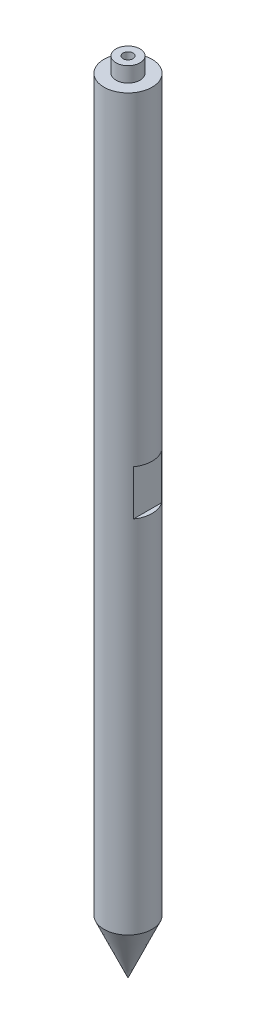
from build123d import *

# Parameters (mm, degrees)
SKETCH_10_R              = 4
EXTRUDE_1_DEPTH          = 5
CUT_EXTRUDE_1_DEPTH      = 261.246037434
CUT_EXTRUDE_1_DEPTH_BACK = 261.246037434
SKETCH_19_W              = 40
SKETCH_19_H              = 15
HOLE_WIZARD_M4_1_D       = 3.3
HOLE_WIZARD_M4_1_DEPTH   = 10.1
HOLE_WIZARD_M4_1_TIP     = 0.991420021


with BuildPart() as part:
    # Sketch 1 → Revolve 1 (revolve)
    with BuildSketch(Plane.XY, mode=Mode.PRIVATE) as revolve_1_sk:
        Polygon((0, 0), (-8, 0), (-8, -242), (0, -260), align=None)
    revolve(revolve_1_sk.sketch.rotate(Axis((0, -260, 0), (0, 1, 0)), 270), axis=Axis((0, -260, 0), (0, 1, 0)))

    # Sketch 10 → Extrude 1 (add)
    with BuildSketch(Plane(origin=(0, 0, 0), x_dir=(1, 0, 0), z_dir=(0, 1, 0))):
        with Locations(Location((0, 0, 0), (0, 0, 270))):
            Circle(SKETCH_10_R)
    extrude(amount=EXTRUDE_1_DEPTH)

    # Sketch 19 → Cut-Extrude 1 (cut, two sides: drawn at the far end of the back side and taken through both)
    with BuildSketch(Plane.XY.offset(-CUT_EXTRUDE_1_DEPTH_BACK)):
        with Locations((26.5, -115)):
            Rectangle(SKETCH_19_W, SKETCH_19_H)
        with Locations((-26.5, -115)):
            Rectangle(SKETCH_19_W, SKETCH_19_H)
    extrude(amount=CUT_EXTRUDE_1_DEPTH + CUT_EXTRUDE_1_DEPTH_BACK, mode=Mode.SUBTRACT)

    # Hole Wizard M4 _1
    with Locations(Plane(origin=(0, 5, 0), x_dir=(1, 0, 0), z_dir=(0, 1, 0))):
        with Locations((0, 0)):
            Hole(HOLE_WIZARD_M4_1_D / 2, depth=HOLE_WIZARD_M4_1_DEPTH)
            with Locations((0, 0, -(HOLE_WIZARD_M4_1_DEPTH + HOLE_WIZARD_M4_1_TIP / 2))):  # 118° drill point
                Cone(0, HOLE_WIZARD_M4_1_D / 2, HOLE_WIZARD_M4_1_TIP, mode=Mode.SUBTRACT)


solid = part.part
